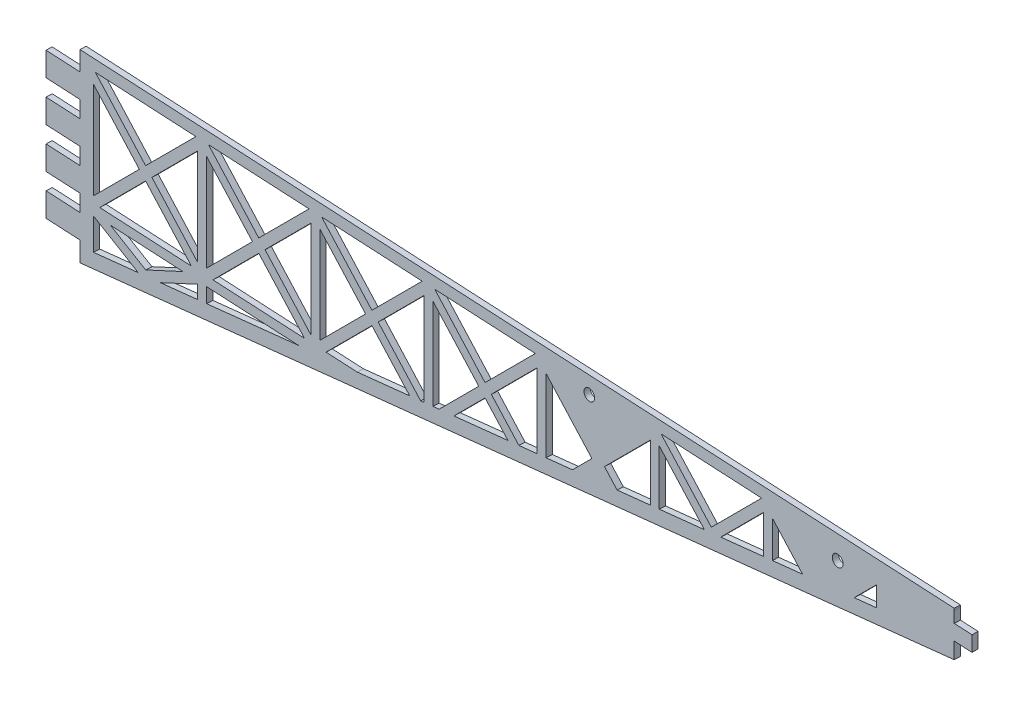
from build123d import *

# Parameters (mm, degrees)
SKETCH1_W               = 36.83
SKETCH1_H               = 3.175
BOSS_EXTRUDE1_DEPTH     = 104.3
CUT_EXTRUDE1_DEPTH      = 610.665336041
CUT_EXTRUDE1_DEPTH_BACK = 610.665336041
SKETCH6_R               = 3
CUT_EXTRUDE5_DEPTH      = 610.673582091
CUT_EXTRUDE6_DEPTH      = 610.665336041
CUT_EXTRUDE6_DEPTH_BACK = 610.665336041
SKETCH7_W               = 10
SKETCH7_H               = 6
BOSS_EXTRUDE2_DEPTH     = 3.170919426
CUT_EXTRUDE7_DEPTH      = 610.673582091
CUT_EXTRUDE7_DEPTH_BACK = 610.673582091
SKETCH12_W              = 36.782665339
SKETCH12_H              = 104.3
SKETCH12_W_2            = 19.05
SKETCH12_H_2            = 8.89
SKETCH12_H_3            = 9.334281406
BOSS_EXTRUDE3_DEPTH     = 3.170919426
BOSS_EXTRUDE4_DEPTH     = 3.170919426
CUT_EXTRUDE8_DEPTH      = 610.833069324
CUT_EXTRUDE8_DEPTH_BACK = 610.833069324
SKETCH15_R              = 3.048
BOSS_EXTRUDE5_START     = -3.170919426
SKETCH15_3_R            = 3
BOSS_EXTRUDE5_DEPTH     = 3.170919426


with BuildPart() as part:
    # Sketch1 → Boss-Extrude1 (new body)
    with BuildSketch(Plane(origin=(0, 0, 0), x_dir=(1, 0, 0), z_dir=(0, 1, 0))):
        with Locations((18.415, 1.5875)):
            Rectangle(SKETCH1_W, SKETCH1_H)
        Polygon((600, -28.58), (600, -25.405), (36.83, 3.175), (36.83, 0), align=None)
    extrude(amount=BOSS_EXTRUDE1_DEPTH)

    # Sketch2 → Cut-Extrude1 (cut, two sides: drawn at the far end of the back side and taken through both)
    with BuildSketch(Plane(origin=(0.094608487, 0, -1.86426388), x_dir=(0.9987147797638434, 0, 0.05068321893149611), z_dir=(-0.05068321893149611, 0, 0.9987147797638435)).offset(-CUT_EXTRUDE1_DEPTH_BACK)):
        Polygon((600.677394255, 84.16), (590.677394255, 84.16), (36.782665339, 0), (600.677394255, 0), align=None)
    extrude(amount=CUT_EXTRUDE1_DEPTH + CUT_EXTRUDE1_DEPTH_BACK, mode=Mode.SUBTRACT)

    # Sketch6 → Cut-Extrude5 (cut, through all)
    with BuildSketch(Plane(origin=(0.255320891, 0, -5.031107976), x_dir=(-0.9987147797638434, 0, -0.05068321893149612), z_dir=(0.05068321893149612, 0, -0.9987147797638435))):
        Polygon((-73.371746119, 64.014466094), (-99.086212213, 38.3), (-47.657280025, 38.3), align=None)
        Polygon((-69.836212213, 67.55), (-41.621746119, 39.335533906), (-41.621746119, 95.764466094), align=None)
        Polygon((-48.8012689, 33.3), (-97.949980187, 33.3), (-73.39257694, 13.810903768), align=None)
        Polygon((-102.621746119, 30.62435225), (-102.621746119, 15.061123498), (-78.367552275, 11.375887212), align=None)
        Polygon((-41.621746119, 32.610086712), (-70.016155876, 10.106957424), (-41.621746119, 5.792647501), align=None)
        Polygon((-132.700196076, 19.631310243), (-107.621746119, 15.820834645), (-107.621746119, 32.555841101), align=None)
        Polygon((-136.943472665, 23.069422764), (-117.092305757, 33.3), (-157.833051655, 33.3), align=None)
        Polygon((-166.121746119, 24.709455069), (-145.155499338, 21.52379679), (-166.121746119, 31.791921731), align=None)
        Polygon((-222.659977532, 33.3), (-171.121746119, 25.469166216), (-171.121746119, 33.3), align=None)
        Polygon((-226.086212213, 38.3), (-174.657280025, 38.3), (-200.371746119, 64.014466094), align=None)
        Polygon((-196.836212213, 67.55), (-171.121746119, 41.835533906), (-171.121746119, 93.264466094), align=None)
        Polygon((-166.121746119, 41.835533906), (-140.407280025, 67.55), (-166.121746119, 93.264466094), align=None)
        Polygon((-165.086212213, 99.3), (-136.871746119, 71.085533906), (-108.657280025, 99.3), align=None)
        Polygon((-133.336212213, 67.55), (-107.621746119, 41.835533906), (-107.621746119, 93.264466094), align=None)
        Polygon((-162.586212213, 38.3), (-111.157280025, 38.3), (-136.871746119, 64.014466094), align=None)
        Polygon((-102.621746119, 93.264466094), (-102.621746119, 41.835533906), (-76.907280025, 67.55), align=None)
        Polygon((-101.586212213, 99.3), (-73.371746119, 71.085533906), (-45.157280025, 99.3), align=None)
        Polygon((-228.586212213, 99.3), (-200.371746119, 71.085533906), (-172.157280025, 99.3), align=None)
        Polygon((-229.621746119, 93.264466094), (-229.621746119, 41.835533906), (-203.907280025, 67.55), align=None)
        Polygon((-260.336212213, 67.55), (-234.621746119, 41.835533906), (-234.621746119, 93.264466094), align=None)
        Polygon((-292.086212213, 99.3), (-263.871746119, 71.085533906), (-235.657280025, 99.3), align=None)
        Polygon((-291.237463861, 43.719816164), (-267.407280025, 67.55), (-293.121746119, 93.264466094), (-293.121746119, 44.006118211), align=None)
        Polygon((-323.836212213, 67.55), (-301.577047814, 45.290835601), (-298.121746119, 44.765829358), (-298.121746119, 93.264466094), align=None)
        Polygon((-355.586212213, 99.3), (-327.371746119, 71.085533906), (-299.157280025, 99.3), align=None)
        Polygon((-356.621746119, 53.654449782), (-346.361756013, 52.095524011), (-330.907280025, 67.55), (-356.621746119, 93.264466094), align=None)
        Polygon((-340.223368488, 51.162843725), (-309.915003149, 46.557723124), (-327.371746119, 64.014466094), align=None)
        Polygon((-387.336212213, 67.55), (-376.454022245, 56.667810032), (-361.621746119, 54.414160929), (-361.621746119, 93.264466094), align=None)
        Polygon((-420.121746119, 63.302781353), (-401.486048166, 60.471231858), (-394.407280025, 67.55), (-420.121746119, 93.264466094), align=None)
        Polygon((-450.471952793, 67.91425942), (-425.121746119, 64.0624925), (-425.121746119, 93.264466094), align=None)
        Polygon((-482.586212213, 99.3), (-454.371746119, 71.085533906), (-426.157280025, 99.3), align=None)
        Polygon((-547.121746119, 82.599444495), (-534.54592644, 80.688646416), (-547.121746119, 93.264466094), align=None)
        Polygon((-505.596244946, 76.289967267), (-488.621746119, 73.710824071), (-488.621746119, 93.264466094), align=None)
        Polygon((-483.621746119, 72.951112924), (-459.66895201, 69.311671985), (-483.621746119, 93.264466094), align=None)
        Polygon((-255.567221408, 38.3), (-238.157280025, 38.3), (-263.871746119, 64.014466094), (-285.099076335, 42.787135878), align=None)
        with Locations((-509.076475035, 92.87)):
            Circle(SKETCH6_R)
        with Locations((-385.886475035, 96.172)):
            Circle(SKETCH6_R)
    extrude(amount=-CUT_EXTRUDE5_DEPTH, mode=Mode.SUBTRACT)

    # Sketch7 → Cut-Extrude6 (cut, two sides: drawn at the far end of the back side and taken through both)
    with BuildSketch(Plane(origin=(0.094608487, 0, -1.86426388), x_dir=(0.9987147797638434, 0, 0.05068321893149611), z_dir=(-0.05068321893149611, 0, 0.9987147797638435)).offset(-CUT_EXTRUDE6_DEPTH_BACK)):
        with Locations((595.677394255, 101.3)):
            Rectangle(SKETCH7_W, SKETCH7_H)
        with Locations((595.677394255, 87.16)):
            Rectangle(SKETCH7_W, SKETCH7_H)
    extrude(amount=CUT_EXTRUDE6_DEPTH + CUT_EXTRUDE6_DEPTH_BACK, mode=Mode.SUBTRACT)

    # Sketch11 → Boss-Extrude2 (add)
    with BuildSketch(Plane(origin=(0.255320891, 0, -5.031107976), x_dir=(-0.9987147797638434, 0, -0.05068321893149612), z_dir=(0.05068321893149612, 0, -0.9987147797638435))):
        Polygon((-73.371746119, 5.559426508), (-73.371746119, 71.085533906), (-73.371746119, 104.3), (-102.621746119, 104.3), (-102.621746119, 93.264466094), (-102.621746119, 41.835533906), (-102.621746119, 10.00373672), align=None)
    extrude(amount=-BOSS_EXTRUDE2_DEPTH)

    # Sketch12 → Cut-Extrude7 (cut, two sides: drawn at the far end of the back side and taken through both)
    with BuildSketch(Plane(origin=(0.255320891, 0, -5.031107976), x_dir=(-0.9987147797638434, 0, -0.05068321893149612), z_dir=(0.05068321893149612, 0, -0.9987147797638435)).offset(-CUT_EXTRUDE7_DEPTH_BACK)):
        with Locations((-18.23041345, 52.15)):
            Rectangle(SKETCH12_W, SKETCH12_H)
        Polygon((-80.971746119, 82.265718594), (-80.971746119, 73.375718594), (-80.971746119, 67.087197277), (-80.971746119, 60.675718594), (-80.971746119, 51.785718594), (-80.971746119, 39.085718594), (-80.971746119, 30.195718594), (-80.971746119, 17.495718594), (-80.971746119, 6.714187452), (-36.782665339, 0), (-36.621746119, 0), (-36.621746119, 104.3), (-80.971746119, 104.3), (-80.971746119, 94.965718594), (-80.971746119, 88.455473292), align=None)
        with Locations((-90.496746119, 34.640718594)):
            Rectangle(SKETCH12_W_2, SKETCH12_H_2)
        with Locations((-90.496746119, 56.230718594)):
            Rectangle(SKETCH12_W_2, SKETCH12_H_2)
        Polygon((-80.971746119, 17.495718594), (-100.021746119, 17.495718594), (-100.021746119, 9.608686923), (-80.971746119, 6.714187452), align=None)
        with Locations((-90.496746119, 77.820718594)):
            Rectangle(SKETCH12_W_2, SKETCH12_H_2)
        with Locations((-90.496746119, 99.632859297)):
            Rectangle(SKETCH12_W_2, SKETCH12_H_3)
    extrude(amount=CUT_EXTRUDE7_DEPTH + CUT_EXTRUDE7_DEPTH_BACK, mode=Mode.SUBTRACT)

    # Sketch13 → Boss-Extrude3 (add)
    with BuildSketch(Plane(origin=(0.094608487, 0, -1.86426388), x_dir=(0.9987147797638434, 0, 0.05068321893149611), z_dir=(-0.05068321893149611, 0, 0.9987147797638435))):
        Polygon((100.021746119, 104.3), (100.021746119, 105.2760204), (590.676767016, 105.2760204), (590.677394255, 104.3), align=None)
    extrude(amount=-BOSS_EXTRUDE3_DEPTH)

    # Sketch14 → Boss-Extrude4 (add)
    with BuildSketch(Plane(origin=(0.094608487, 0, -1.86426388), x_dir=(0.9987147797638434, 0, 0.05068321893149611), z_dir=(-0.05068321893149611, 0, 0.9987147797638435))):
        Polygon((100.021746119, 9.608686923), (100.021746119, 6.976153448), (590.677394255, 81.527466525), (590.677394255, 84.16), align=None)
    extrude(amount=-BOSS_EXTRUDE4_DEPTH)

    # Sketch15 → Cut-Extrude8 (cut, two sides: drawn at the far end of the back side and taken through both)
    with BuildSketch(Plane(origin=(0.094608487, 0, -1.86426388), x_dir=(0.9987147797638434, 0, 0.05068321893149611), z_dir=(-0.05068321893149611, 0, 0.9987147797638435)).offset(-CUT_EXTRUDE8_DEPTH_BACK)):
        with Locations((525.276475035, 92.87)):
            Circle(SKETCH15_R)
    extrude(amount=CUT_EXTRUDE8_DEPTH + CUT_EXTRUDE8_DEPTH_BACK, mode=Mode.SUBTRACT)

    # Sketch15_3 → Boss-Extrude5 (add)
    with BuildSketch(Plane(origin=(0.094608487, 0, -1.86426388), x_dir=(0.9987147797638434, 0, 0.05068321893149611), z_dir=(-0.05068321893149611, 0, 0.9987147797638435)).offset(BOSS_EXTRUDE5_START)):
        with Locations((509.076475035, 92.87)):
            Circle(SKETCH15_3_R)
    extrude(amount=BOSS_EXTRUDE5_DEPTH)


solid = part.part
